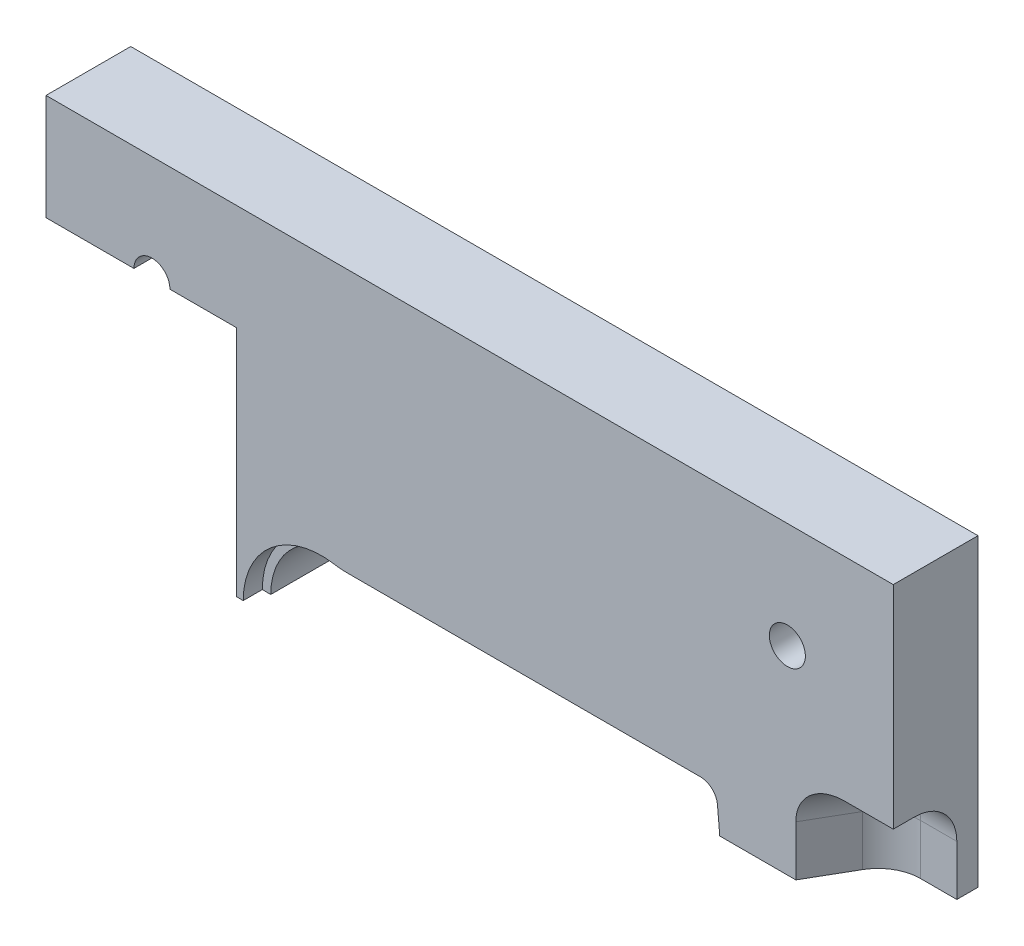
ISO-10303-21;
HEADER;
FILE_DESCRIPTION(('STEP AP214'),'2;1');
FILE_NAME('part.step','',(''),(''),'','','');
FILE_SCHEMA(('AUTOMOTIVE_DESIGN { 1 0 10303 214 1 1 1 1 }'));
ENDSEC;
DATA;
#1=APPLICATION_CONTEXT('core data for automotive mechanical design processes');
#2=APPLICATION_PROTOCOL_DEFINITION('international standard','automotive_design',2000,#1);
#3=PRODUCT_CONTEXT('',#1,'mechanical');
#4=PRODUCT('Part','Part','',(#3));
#5=PRODUCT_RELATED_PRODUCT_CATEGORY('part','',(#4));
#6=PRODUCT_DEFINITION_FORMATION('','',#4);
#7=PRODUCT_DEFINITION_CONTEXT('part definition',#1,'design');
#8=PRODUCT_DEFINITION('design','',#6,#7);
#9=PRODUCT_DEFINITION_SHAPE('','',#8);
#10=(LENGTH_UNIT() NAMED_UNIT(*) SI_UNIT(.MILLI.,.METRE.));
#11=(NAMED_UNIT(*) PLANE_ANGLE_UNIT() SI_UNIT($,.RADIAN.));
#12=(NAMED_UNIT(*) SI_UNIT($,.STERADIAN.) SOLID_ANGLE_UNIT());
#13=UNCERTAINTY_MEASURE_WITH_UNIT(LENGTH_MEASURE(1.E-05),#10,'distance_accuracy_value','');
#14=(GEOMETRIC_REPRESENTATION_CONTEXT(3) GLOBAL_UNCERTAINTY_ASSIGNED_CONTEXT((#13)) GLOBAL_UNIT_ASSIGNED_CONTEXT((#10,
#11,#12)) REPRESENTATION_CONTEXT('',''));
#15=CARTESIAN_POINT('',(0.,0.,0.));
#16=DIRECTION('',(0.,0.,1.));
#17=DIRECTION('',(1.,0.,0.));
#18=AXIS2_PLACEMENT_3D('',#15,#16,#17);
#19=CARTESIAN_POINT('',(175.,125.,20.));
#20=DIRECTION('',(0.,0.,1.));
#21=DIRECTION('',(1.,0.,0.));
#22=AXIS2_PLACEMENT_3D('',#19,#20,#21);
#23=CYLINDRICAL_SURFACE('',#22,4.24999999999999);
#24=CARTESIAN_POINT('',(175.,125.,20.));
#25=DIRECTION('',(0.,0.,1.));
#26=DIRECTION('',(1.,0.,0.));
#27=AXIS2_PLACEMENT_3D('',#24,#25,#26);
#28=CIRCLE('',#27,4.24999999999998);
#29=CARTESIAN_POINT('',(179.25,125.,20.));
#30=VERTEX_POINT('',#29);
#31=EDGE_CURVE('E355',#30,#30,#28,.T.);
#32=ORIENTED_EDGE('',*,*,#31,.T.);
#33=EDGE_LOOP('',(#32));
#34=FACE_BOUND('',#33,.T.);
#35=CARTESIAN_POINT('',(175.,125.,5.));
#36=DIRECTION('',(0.,0.,-1.));
#37=DIRECTION('',(-1.,0.,0.));
#38=AXIS2_PLACEMENT_3D('',#35,#36,#37);
#39=CIRCLE('',#38,4.24999999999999);
#40=CARTESIAN_POINT('',(170.75,125.,5.));
#41=VERTEX_POINT('',#40);
#42=EDGE_CURVE('E244',#41,#41,#39,.F.);
#43=ORIENTED_EDGE('',*,*,#42,.F.);
#44=EDGE_LOOP('',(#43));
#45=FACE_BOUND('',#44,.T.);
#46=ADVANCED_FACE('F28',(#34,#45),#23,.F.);
#47=CARTESIAN_POINT('',(25.,125.,20.));
#48=DIRECTION('',(0.,0.,1.));
#49=DIRECTION('',(1.,0.,0.));
#50=AXIS2_PLACEMENT_3D('',#47,#48,#49);
#51=CYLINDRICAL_SURFACE('',#50,4.24999999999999);
#52=CARTESIAN_POINT('',(25.,125.,20.));
#53=DIRECTION('',(0.,0.,1.));
#54=DIRECTION('',(1.,0.,0.));
#55=AXIS2_PLACEMENT_3D('',#52,#53,#54);
#56=CIRCLE('',#55,4.24999999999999);
#57=CARTESIAN_POINT('',(29.25,125.,20.));
#58=VERTEX_POINT('',#57);
#59=CARTESIAN_POINT('',(20.75,125.,20.));
#60=VERTEX_POINT('',#59);
#61=EDGE_CURVE('E361',#58,#60,#56,.T.);
#62=ORIENTED_EDGE('',*,*,#61,.T.);
#63=DIRECTION('',(0.,0.,1.));
#64=VECTOR('',#63,1.);
#65=CARTESIAN_POINT('',(20.75,125.,20.));
#66=LINE('',#65,#64);
#67=CARTESIAN_POINT('',(20.75,125.,5.));
#68=VERTEX_POINT('',#67);
#69=EDGE_CURVE('E522',#60,#68,#66,.F.);
#70=ORIENTED_EDGE('',*,*,#69,.T.);
#71=CARTESIAN_POINT('',(25.,125.,5.));
#72=DIRECTION('',(0.,0.,-1.));
#73=DIRECTION('',(-1.,0.,0.));
#74=AXIS2_PLACEMENT_3D('',#71,#72,#73);
#75=CIRCLE('',#74,4.24999999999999);
#76=CARTESIAN_POINT('',(29.25,125.,5.));
#77=VERTEX_POINT('',#76);
#78=EDGE_CURVE('E353',#77,#68,#75,.F.);
#79=ORIENTED_EDGE('',*,*,#78,.F.);
#80=DIRECTION('',(0.,0.,1.));
#81=VECTOR('',#80,1.);
#82=CARTESIAN_POINT('',(29.25,125.,20.));
#83=LINE('',#82,#81);
#84=EDGE_CURVE('E531',#77,#58,#83,.T.);
#85=ORIENTED_EDGE('',*,*,#84,.T.);
#86=EDGE_LOOP('',(#62,#70,#79,#85));
#87=FACE_BOUND('',#86,.T.);
#88=ADVANCED_FACE('F444',(#87),#51,.F.);
#89=CARTESIAN_POINT('',(0.,150.,0.));
#90=DIRECTION('',(0.,0.,-1.));
#91=DIRECTION('',(-1.,0.,0.));
#92=AXIS2_PLACEMENT_3D('',#89,#90,#91);
#93=PLANE('',#92);
#94=DIRECTION('',(1.,0.,0.));
#95=VECTOR('',#94,1.);
#96=CARTESIAN_POINT('',(0.,125.,0.));
#97=LINE('',#96,#95);
#98=CARTESIAN_POINT('',(0.,125.,0.));
#99=VERTEX_POINT('',#98);
#100=CARTESIAN_POINT('',(12.,125.,0.));
#101=VERTEX_POINT('',#100);
#102=EDGE_CURVE('E43',#99,#101,#97,.T.);
#103=ORIENTED_EDGE('',*,*,#102,.F.);
#104=DIRECTION('',(0.,-1.,0.));
#105=VECTOR('',#104,1.);
#106=CARTESIAN_POINT('',(0.,0.,0.));
#107=LINE('',#106,#105);
#108=CARTESIAN_POINT('',(0.,150.,0.));
#109=VERTEX_POINT('',#108);
#110=EDGE_CURVE('E324',#109,#99,#107,.T.);
#111=ORIENTED_EDGE('',*,*,#110,.F.);
#112=DIRECTION('',(-1.,0.,0.));
#113=VECTOR('',#112,1.);
#114=CARTESIAN_POINT('',(0.,150.,0.));
#115=LINE('',#114,#113);
#116=CARTESIAN_POINT('',(200.,150.,0.));
#117=VERTEX_POINT('',#116);
#118=EDGE_CURVE('E340',#117,#109,#115,.T.);
#119=ORIENTED_EDGE('',*,*,#118,.F.);
#120=DIRECTION('',(0.,1.,0.));
#121=VECTOR('',#120,1.);
#122=CARTESIAN_POINT('',(200.,0.,0.));
#123=LINE('',#122,#121);
#124=CARTESIAN_POINT('',(200.,78.12,0.));
#125=VERTEX_POINT('',#124);
#126=EDGE_CURVE('E338',#125,#117,#123,.T.);
#127=ORIENTED_EDGE('',*,*,#126,.F.);
#128=DIRECTION('',(1.,0.,0.));
#129=VECTOR('',#128,1.);
#130=CARTESIAN_POINT('',(0.,78.12,0.));
#131=LINE('',#130,#129);
#132=CARTESIAN_POINT('',(157.033723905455,78.12,0.));
#133=VERTEX_POINT('',#132);
#134=EDGE_CURVE('E538',#133,#125,#131,.T.);
#135=ORIENTED_EDGE('',*,*,#134,.F.);
#136=DIRECTION('',(-0.0871557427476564,0.996194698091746,0.));
#137=VECTOR('',#136,1.);
#138=CARTESIAN_POINT('',(156.512122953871,84.0819261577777,0.));
#139=LINE('',#138,#137);
#140=CARTESIAN_POINT('',(156.512122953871,84.0819261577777,0.));
#141=VERTEX_POINT('',#140);
#142=EDGE_CURVE('E311',#133,#141,#139,.T.);
#143=ORIENTED_EDGE('',*,*,#142,.T.);
#144=CARTESIAN_POINT('',(154.489847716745,83.905,0.));
#145=DIRECTION('',(0.,0.,1.));
#146=DIRECTION('',(-1.,0.,0.));
#147=AXIS2_PLACEMENT_3D('',#144,#145,#146);
#148=CIRCLE('',#147,2.03);
#149=CARTESIAN_POINT('',(154.489847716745,85.935,0.));
#150=VERTEX_POINT('',#149);
#151=EDGE_CURVE('E314',#141,#150,#148,.T.);
#152=ORIENTED_EDGE('',*,*,#151,.T.);
#153=DIRECTION('',(-1.,0.,0.));
#154=VECTOR('',#153,1.);
#155=CARTESIAN_POINT('',(71.0781905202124,85.935,0.));
#156=LINE('',#155,#154);
#157=CARTESIAN_POINT('',(71.0781905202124,85.935,0.));
#158=VERTEX_POINT('',#157);
#159=EDGE_CURVE('E317',#150,#158,#156,.T.);
#160=ORIENTED_EDGE('',*,*,#159,.T.);
#161=CARTESIAN_POINT('',(71.0781905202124,105.965,0.));
#162=DIRECTION('',(0.,0.,-1.));
#163=DIRECTION('',(-1.,0.,0.));
#164=AXIS2_PLACEMENT_3D('',#161,#162,#163);
#165=CIRCLE('',#164,20.03);
#166=CARTESIAN_POINT('',(67.7403932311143,86.2150630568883,0.));
#167=VERTEX_POINT('',#166);
#168=EDGE_CURVE('E305',#158,#167,#165,.T.);
#169=ORIENTED_EDGE('',*,*,#168,.T.);
#170=CARTESIAN_POINT('',(65.,70.,0.));
#171=DIRECTION('',(0.,0.,1.));
#172=DIRECTION('',(1.,0.,0.));
#173=AXIS2_PLACEMENT_3D('',#170,#171,#172);
#174=CIRCLE('',#173,16.445);
#175=CARTESIAN_POINT('',(48.555,70.,0.));
#176=VERTEX_POINT('',#175);
#177=EDGE_CURVE('E308',#167,#176,#174,.T.);
#178=ORIENTED_EDGE('',*,*,#177,.T.);
#179=DIRECTION('',(1.,0.,0.));
#180=VECTOR('',#179,1.);
#181=CARTESIAN_POINT('',(0.,70.,0.));
#182=LINE('',#181,#180);
#183=CARTESIAN_POINT('',(45.,70.,0.));
#184=VERTEX_POINT('',#183);
#185=EDGE_CURVE('E408',#184,#176,#182,.T.);
#186=ORIENTED_EDGE('',*,*,#185,.F.);
#187=DIRECTION('',(0.,-1.,0.));
#188=VECTOR('',#187,1.);
#189=CARTESIAN_POINT('',(45.,150.,0.));
#190=LINE('',#189,#188);
#191=CARTESIAN_POINT('',(45.,125.,0.));
#192=VERTEX_POINT('',#191);
#193=EDGE_CURVE('E415',#192,#184,#190,.T.);
#194=ORIENTED_EDGE('',*,*,#193,.F.);
#195=CARTESIAN_POINT('',(38.,125.,0.));
#196=VERTEX_POINT('',#195);
#197=EDGE_CURVE('E525',#196,#192,#97,.T.);
#198=ORIENTED_EDGE('',*,*,#197,.F.);
#199=CARTESIAN_POINT('',(25.,125.,0.));
#200=DIRECTION('',(0.,0.,-1.));
#201=DIRECTION('',(-1.,0.,0.));
#202=AXIS2_PLACEMENT_3D('',#199,#200,#201);
#203=CIRCLE('',#202,13.);
#204=EDGE_CURVE('E364',#101,#196,#203,.T.);
#205=ORIENTED_EDGE('',*,*,#204,.F.);
#206=EDGE_LOOP('',(#103,#111,#119,#127,#135,#143,#152,#160,#169,#178,#186,#194,#198,#205));
#207=FACE_BOUND('',#206,.T.);
#208=CARTESIAN_POINT('',(175.,125.,0.));
#209=DIRECTION('',(0.,0.,-1.));
#210=DIRECTION('',(-1.,0.,0.));
#211=AXIS2_PLACEMENT_3D('',#208,#209,#210);
#212=CIRCLE('',#211,13.);
#213=CARTESIAN_POINT('',(162.,125.,0.));
#214=VERTEX_POINT('',#213);
#215=EDGE_CURVE('E432',#214,#214,#212,.T.);
#216=ORIENTED_EDGE('',*,*,#215,.F.);
#217=EDGE_LOOP('',(#216));
#218=FACE_BOUND('',#217,.T.);
#219=ADVANCED_FACE('F450',(#207,#218),#93,.T.);
#220=CARTESIAN_POINT('',(71.0781905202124,105.965,0.));
#221=DIRECTION('',(0.,0.,1.));
#222=DIRECTION('',(1.,0.,0.));
#223=AXIS2_PLACEMENT_3D('',#220,#221,#222);
#224=CYLINDRICAL_SURFACE('',#223,20.03);
#225=CARTESIAN_POINT('',(71.0781905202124,105.965,15.5));
#226=DIRECTION('',(0.,0.,1.));
#227=DIRECTION('',(1.,0.,0.));
#228=AXIS2_PLACEMENT_3D('',#225,#226,#227);
#229=CIRCLE('',#228,20.03);
#230=CARTESIAN_POINT('',(67.7403932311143,86.2150630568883,15.5));
#231=VERTEX_POINT('',#230);
#232=CARTESIAN_POINT('',(71.0781905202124,85.935,15.5));
#233=VERTEX_POINT('',#232);
#234=EDGE_CURVE('E303',#231,#233,#229,.T.);
#235=ORIENTED_EDGE('',*,*,#234,.F.);
#236=DIRECTION('',(0.,0.,1.));
#237=VECTOR('',#236,1.);
#238=CARTESIAN_POINT('',(67.7403932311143,86.2150630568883,0.));
#239=LINE('',#238,#237);
#240=EDGE_CURVE('E320',#167,#231,#239,.T.);
#241=ORIENTED_EDGE('',*,*,#240,.F.);
#242=ORIENTED_EDGE('',*,*,#168,.F.);
#243=DIRECTION('',(0.,0.,1.));
#244=VECTOR('',#243,1.);
#245=CARTESIAN_POINT('',(71.0781905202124,85.935,0.));
#246=LINE('',#245,#244);
#247=EDGE_CURVE('E321',#158,#233,#246,.T.);
#248=ORIENTED_EDGE('',*,*,#247,.T.);
#249=EDGE_LOOP('',(#235,#241,#242,#248));
#250=FACE_BOUND('',#249,.T.);
#251=ADVANCED_FACE('F478',(#250),#224,.T.);
#252=CARTESIAN_POINT('',(71.0781905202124,85.935,0.));
#253=DIRECTION('',(0.,1.,0.));
#254=DIRECTION('',(-1.,0.,0.));
#255=AXIS2_PLACEMENT_3D('',#252,#253,#254);
#256=PLANE('',#255);
#257=DIRECTION('',(1.,0.,0.));
#258=VECTOR('',#257,1.);
#259=CARTESIAN_POINT('',(71.0781905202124,85.935,15.5));
#260=LINE('',#259,#258);
#261=CARTESIAN_POINT('',(154.489847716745,85.935,15.5));
#262=VERTEX_POINT('',#261);
#263=EDGE_CURVE('E301',#233,#262,#260,.T.);
#264=ORIENTED_EDGE('',*,*,#263,.F.);
#265=ORIENTED_EDGE('',*,*,#247,.F.);
#266=ORIENTED_EDGE('',*,*,#159,.F.);
#267=DIRECTION('',(0.,0.,1.));
#268=VECTOR('',#267,1.);
#269=CARTESIAN_POINT('',(154.489847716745,85.935,0.));
#270=LINE('',#269,#268);
#271=EDGE_CURVE('E325',#150,#262,#270,.T.);
#272=ORIENTED_EDGE('',*,*,#271,.T.);
#273=EDGE_LOOP('',(#264,#265,#266,#272));
#274=FACE_BOUND('',#273,.T.);
#275=ADVANCED_FACE('F474',(#274),#256,.F.);
#276=CARTESIAN_POINT('',(154.489847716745,83.905,0.));
#277=DIRECTION('',(0.,0.,1.));
#278=DIRECTION('',(1.,0.,0.));
#279=AXIS2_PLACEMENT_3D('',#276,#277,#278);
#280=CYLINDRICAL_SURFACE('',#279,2.03);
#281=CARTESIAN_POINT('',(154.489847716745,83.905,15.5));
#282=DIRECTION('',(0.,0.,1.));
#283=DIRECTION('',(1.,0.,0.));
#284=AXIS2_PLACEMENT_3D('',#281,#282,#283);
#285=CIRCLE('',#284,2.03);
#286=CARTESIAN_POINT('',(156.512122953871,84.0819261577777,15.5));
#287=VERTEX_POINT('',#286);
#288=EDGE_CURVE('E299',#262,#287,#285,.F.);
#289=ORIENTED_EDGE('',*,*,#288,.F.);
#290=ORIENTED_EDGE('',*,*,#271,.F.);
#291=ORIENTED_EDGE('',*,*,#151,.F.);
#292=DIRECTION('',(0.,0.,1.));
#293=VECTOR('',#292,1.);
#294=CARTESIAN_POINT('',(156.512122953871,84.0819261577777,0.));
#295=LINE('',#294,#293);
#296=EDGE_CURVE('E328',#141,#287,#295,.T.);
#297=ORIENTED_EDGE('',*,*,#296,.T.);
#298=EDGE_LOOP('',(#289,#290,#291,#297));
#299=FACE_BOUND('',#298,.T.);
#300=ADVANCED_FACE('F477',(#299),#280,.F.);
#301=CARTESIAN_POINT('',(156.512122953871,84.0819261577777,0.));
#302=DIRECTION('',(0.996194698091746,0.0871557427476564,0.));
#303=DIRECTION('',(-0.0871557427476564,0.996194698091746,0.));
#304=AXIS2_PLACEMENT_3D('',#301,#302,#303);
#305=PLANE('',#304);
#306=DIRECTION('',(0.0871557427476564,-0.996194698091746,0.));
#307=VECTOR('',#306,1.);
#308=CARTESIAN_POINT('',(156.512122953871,84.0819261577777,15.5));
#309=LINE('',#308,#307);
#310=CARTESIAN_POINT('',(157.033723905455,78.12,15.5));
#311=VERTEX_POINT('',#310);
#312=EDGE_CURVE('E291',#287,#311,#309,.T.);
#313=ORIENTED_EDGE('',*,*,#312,.F.);
#314=ORIENTED_EDGE('',*,*,#296,.F.);
#315=ORIENTED_EDGE('',*,*,#142,.F.);
#316=DIRECTION('',(0.,0.,1.));
#317=VECTOR('',#316,1.);
#318=CARTESIAN_POINT('',(157.033723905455,78.12,0.));
#319=LINE('',#318,#317);
#320=EDGE_CURVE('E331',#133,#311,#319,.T.);
#321=ORIENTED_EDGE('',*,*,#320,.T.);
#322=EDGE_LOOP('',(#313,#314,#315,#321));
#323=FACE_BOUND('',#322,.T.);
#324=ADVANCED_FACE('F482',(#323),#305,.F.);
#325=CARTESIAN_POINT('',(65.,70.,0.));
#326=DIRECTION('',(0.,0.,1.));
#327=DIRECTION('',(1.,0.,0.));
#328=AXIS2_PLACEMENT_3D('',#325,#326,#327);
#329=CYLINDRICAL_SURFACE('',#328,16.445);
#330=CARTESIAN_POINT('',(65.,70.,15.5));
#331=DIRECTION('',(0.,0.,1.));
#332=DIRECTION('',(1.,0.,0.));
#333=AXIS2_PLACEMENT_3D('',#330,#331,#332);
#334=CIRCLE('',#333,16.445);
#335=CARTESIAN_POINT('',(48.555,70.,15.5));
#336=VERTEX_POINT('',#335);
#337=EDGE_CURVE('E237',#336,#231,#334,.F.);
#338=ORIENTED_EDGE('',*,*,#337,.F.);
#339=DIRECTION('',(0.,0.,1.));
#340=VECTOR('',#339,1.);
#341=CARTESIAN_POINT('',(48.555,70.,0.));
#342=LINE('',#341,#340);
#343=EDGE_CURVE('E405',#336,#176,#342,.F.);
#344=ORIENTED_EDGE('',*,*,#343,.T.);
#345=ORIENTED_EDGE('',*,*,#177,.F.);
#346=ORIENTED_EDGE('',*,*,#240,.T.);
#347=EDGE_LOOP('',(#338,#344,#345,#346));
#348=FACE_BOUND('',#347,.T.);
#349=ADVANCED_FACE('F486',(#348),#329,.F.);
#350=CARTESIAN_POINT('',(0.,0.,20.));
#351=DIRECTION('',(1.,0.,0.));
#352=DIRECTION('',(0.,0.,-1.));
#353=AXIS2_PLACEMENT_3D('',#350,#351,#352);
#354=PLANE('',#353);
#355=ORIENTED_EDGE('',*,*,#110,.T.);
#356=DIRECTION('',(0.,0.,1.));
#357=VECTOR('',#356,1.);
#358=CARTESIAN_POINT('',(0.,125.,20.));
#359=LINE('',#358,#357);
#360=CARTESIAN_POINT('',(0.,125.,20.));
#361=VERTEX_POINT('',#360);
#362=EDGE_CURVE('E515',#99,#361,#359,.T.);
#363=ORIENTED_EDGE('',*,*,#362,.T.);
#364=DIRECTION('',(0.,-1.,0.));
#365=VECTOR('',#364,1.);
#366=CARTESIAN_POINT('',(0.,0.,20.));
#367=LINE('',#366,#365);
#368=CARTESIAN_POINT('',(0.,150.,20.));
#369=VERTEX_POINT('',#368);
#370=EDGE_CURVE('E342',#369,#361,#367,.T.);
#371=ORIENTED_EDGE('',*,*,#370,.F.);
#372=DIRECTION('',(0.,0.,-1.));
#373=VECTOR('',#372,1.);
#374=CARTESIAN_POINT('',(0.,150.,20.));
#375=LINE('',#374,#373);
#376=EDGE_CURVE('E349',#369,#109,#375,.T.);
#377=ORIENTED_EDGE('',*,*,#376,.T.);
#378=EDGE_LOOP('',(#355,#363,#371,#377));
#379=FACE_BOUND('',#378,.T.);
#380=ADVANCED_FACE('F490',(#379),#354,.F.);
#381=CARTESIAN_POINT('',(200.,0.,20.));
#382=DIRECTION('',(-1.,0.,0.));
#383=DIRECTION('',(0.,0.,1.));
#384=AXIS2_PLACEMENT_3D('',#381,#382,#383);
#385=PLANE('',#384);
#386=DIRECTION('',(0.,1.,0.));
#387=VECTOR('',#386,1.);
#388=CARTESIAN_POINT('',(200.,100.,5.));
#389=LINE('',#388,#387);
#390=CARTESIAN_POINT('',(200.,78.12,5.));
#391=VERTEX_POINT('',#390);
#392=CARTESIAN_POINT('',(200.,90.,5.));
#393=VERTEX_POINT('',#392);
#394=EDGE_CURVE('E428',#391,#393,#389,.T.);
#395=ORIENTED_EDGE('',*,*,#394,.F.);
#396=DIRECTION('',(0.,0.,-1.));
#397=VECTOR('',#396,1.);
#398=CARTESIAN_POINT('',(200.,78.12,20.));
#399=LINE('',#398,#397);
#400=EDGE_CURVE('E540',#391,#125,#399,.T.);
#401=ORIENTED_EDGE('',*,*,#400,.T.);
#402=ORIENTED_EDGE('',*,*,#126,.T.);
#403=DIRECTION('',(0.,0.,-1.));
#404=VECTOR('',#403,1.);
#405=CARTESIAN_POINT('',(200.,150.,20.));
#406=LINE('',#405,#404);
#407=CARTESIAN_POINT('',(200.,150.,20.));
#408=VERTEX_POINT('',#407);
#409=EDGE_CURVE('E241',#408,#117,#406,.T.);
#410=ORIENTED_EDGE('',*,*,#409,.F.);
#411=DIRECTION('',(0.,1.,0.));
#412=VECTOR('',#411,1.);
#413=CARTESIAN_POINT('',(200.,0.,20.));
#414=LINE('',#413,#412);
#415=CARTESIAN_POINT('',(200.,100.,20.));
#416=VERTEX_POINT('',#415);
#417=EDGE_CURVE('E345',#416,#408,#414,.T.);
#418=ORIENTED_EDGE('',*,*,#417,.F.);
#419=DIRECTION('',(0.,0.,1.));
#420=VECTOR('',#419,1.);
#421=CARTESIAN_POINT('',(200.,100.,5.));
#422=LINE('',#421,#420);
#423=CARTESIAN_POINT('',(200.,100.,15.));
#424=VERTEX_POINT('',#423);
#425=EDGE_CURVE('E430',#424,#416,#422,.T.);
#426=ORIENTED_EDGE('',*,*,#425,.F.);
#427=CARTESIAN_POINT('',(200.,90.,15.));
#428=DIRECTION('',(-1.,0.,0.));
#429=DIRECTION('',(0.,0.,1.));
#430=AXIS2_PLACEMENT_3D('',#427,#428,#429);
#431=CIRCLE('',#430,10.);
#432=EDGE_CURVE('E221',#424,#393,#431,.T.);
#433=ORIENTED_EDGE('',*,*,#432,.T.);
#434=EDGE_LOOP('',(#395,#401,#402,#410,#418,#426,#433));
#435=FACE_BOUND('',#434,.T.);
#436=ADVANCED_FACE('F504',(#435),#385,.F.);
#437=CARTESIAN_POINT('',(0.,150.,20.));
#438=DIRECTION('',(0.,-1.,0.));
#439=DIRECTION('',(0.,0.,-1.));
#440=AXIS2_PLACEMENT_3D('',#437,#438,#439);
#441=PLANE('',#440);
#442=ORIENTED_EDGE('',*,*,#118,.T.);
#443=ORIENTED_EDGE('',*,*,#376,.F.);
#444=DIRECTION('',(-1.,0.,0.));
#445=VECTOR('',#444,1.);
#446=CARTESIAN_POINT('',(0.,150.,20.));
#447=LINE('',#446,#445);
#448=EDGE_CURVE('E347',#408,#369,#447,.T.);
#449=ORIENTED_EDGE('',*,*,#448,.F.);
#450=ORIENTED_EDGE('',*,*,#409,.T.);
#451=EDGE_LOOP('',(#442,#443,#449,#450));
#452=FACE_BOUND('',#451,.T.);
#453=ADVANCED_FACE('F500',(#452),#441,.F.);
#454=CARTESIAN_POINT('',(0.,150.,20.));
#455=DIRECTION('',(0.,0.,-1.));
#456=DIRECTION('',(-1.,0.,0.));
#457=AXIS2_PLACEMENT_3D('',#454,#455,#456);
#458=PLANE('',#457);
#459=ORIENTED_EDGE('',*,*,#31,.F.);
#460=EDGE_LOOP('',(#459));
#461=FACE_BOUND('',#460,.T.);
#462=ORIENTED_EDGE('',*,*,#370,.T.);
#463=DIRECTION('',(1.,0.,0.));
#464=VECTOR('',#463,1.);
#465=CARTESIAN_POINT('',(0.,125.,20.));
#466=LINE('',#465,#464);
#467=EDGE_CURVE('E527',#361,#60,#466,.T.);
#468=ORIENTED_EDGE('',*,*,#467,.T.);
#469=ORIENTED_EDGE('',*,*,#61,.F.);
#470=CARTESIAN_POINT('',(45.,125.,20.));
#471=VERTEX_POINT('',#470);
#472=EDGE_CURVE('E410',#58,#471,#466,.T.);
#473=ORIENTED_EDGE('',*,*,#472,.T.);
#474=DIRECTION('',(0.,-1.,0.));
#475=VECTOR('',#474,1.);
#476=CARTESIAN_POINT('',(45.,150.,20.));
#477=LINE('',#476,#475);
#478=CARTESIAN_POINT('',(45.,70.,20.));
#479=VERTEX_POINT('',#478);
#480=EDGE_CURVE('E11',#471,#479,#477,.T.);
#481=ORIENTED_EDGE('',*,*,#480,.T.);
#482=DIRECTION('',(1.,0.,0.));
#483=VECTOR('',#482,1.);
#484=CARTESIAN_POINT('',(0.,70.,20.));
#485=LINE('',#484,#483);
#486=CARTESIAN_POINT('',(46.555,70.,20.));
#487=VERTEX_POINT('',#486);
#488=EDGE_CURVE('E401',#479,#487,#485,.T.);
#489=ORIENTED_EDGE('',*,*,#488,.T.);
#490=CARTESIAN_POINT('',(65.,70.,20.));
#491=DIRECTION('',(0.,0.,1.));
#492=DIRECTION('',(1.,0.,0.));
#493=AXIS2_PLACEMENT_3D('',#490,#491,#492);
#494=CIRCLE('',#493,18.445);
#495=CARTESIAN_POINT('',(68.0736730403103,88.1870986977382,20.));
#496=VERTEX_POINT('',#495);
#497=EDGE_CURVE('E269',#496,#487,#494,.T.);
#498=ORIENTED_EDGE('',*,*,#497,.F.);
#499=CARTESIAN_POINT('',(71.0781905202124,105.965,20.));
#500=DIRECTION('',(0.,0.,-1.));
#501=DIRECTION('',(1.,0.,0.));
#502=AXIS2_PLACEMENT_3D('',#499,#500,#501);
#503=CIRCLE('',#502,18.03);
#504=CARTESIAN_POINT('',(71.0781905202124,87.935,20.));
#505=VERTEX_POINT('',#504);
#506=EDGE_CURVE('E382',#505,#496,#503,.T.);
#507=ORIENTED_EDGE('',*,*,#506,.F.);
#508=DIRECTION('',(-1.,0.,0.));
#509=VECTOR('',#508,1.);
#510=CARTESIAN_POINT('',(154.489847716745,87.935,20.));
#511=LINE('',#510,#509);
#512=CARTESIAN_POINT('',(154.489847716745,87.935,20.));
#513=VERTEX_POINT('',#512);
#514=EDGE_CURVE('E379',#513,#505,#511,.T.);
#515=ORIENTED_EDGE('',*,*,#514,.F.);
#516=CARTESIAN_POINT('',(154.489847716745,83.905,20.));
#517=DIRECTION('',(0.,0.,1.));
#518=DIRECTION('',(1.,0.,0.));
#519=AXIS2_PLACEMENT_3D('',#516,#517,#518);
#520=CIRCLE('',#519,4.03);
#521=CARTESIAN_POINT('',(158.504512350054,84.2562376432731,20.));
#522=VERTEX_POINT('',#521);
#523=EDGE_CURVE('E376',#522,#513,#520,.T.);
#524=ORIENTED_EDGE('',*,*,#523,.F.);
#525=DIRECTION('',(-0.0871557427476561,0.996194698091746,0.));
#526=VECTOR('',#525,1.);
#527=CARTESIAN_POINT('',(159.041363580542,78.12,20.));
#528=LINE('',#527,#526);
#529=CARTESIAN_POINT('',(159.041363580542,78.12,20.));
#530=VERTEX_POINT('',#529);
#531=EDGE_CURVE('E373',#530,#522,#528,.T.);
#532=ORIENTED_EDGE('',*,*,#531,.F.);
#533=DIRECTION('',(1.,0.,0.));
#534=VECTOR('',#533,1.);
#535=CARTESIAN_POINT('',(0.,78.12,20.));
#536=LINE('',#535,#534);
#537=CARTESIAN_POINT('',(177.,78.12,20.));
#538=VERTEX_POINT('',#537);
#539=EDGE_CURVE('E230',#530,#538,#536,.T.);
#540=ORIENTED_EDGE('',*,*,#539,.T.);
#541=DIRECTION('',(0.,-1.,0.));
#542=VECTOR('',#541,1.);
#543=CARTESIAN_POINT('',(177.,100.,20.));
#544=LINE('',#543,#542);
#545=CARTESIAN_POINT('',(177.,90.,20.));
#546=VERTEX_POINT('',#545);
#547=EDGE_CURVE('E229',#546,#538,#544,.T.);
#548=ORIENTED_EDGE('',*,*,#547,.F.);
#549=CARTESIAN_POINT('',(188.547005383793,90.,20.));
#550=DIRECTION('',(0.,0.,-1.));
#551=DIRECTION('',(-1.,0.,0.));
#552=AXIS2_PLACEMENT_3D('',#549,#550,#551);
#553=ELLIPSE('',#552,11.5470053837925,10.);
#554=CARTESIAN_POINT('',(188.547005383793,100.,20.));
#555=VERTEX_POINT('',#554);
#556=EDGE_CURVE('E254',#546,#555,#553,.T.);
#557=ORIENTED_EDGE('',*,*,#556,.T.);
#558=DIRECTION('',(-1.,0.,0.));
#559=VECTOR('',#558,1.);
#560=CARTESIAN_POINT('',(200.,100.,20.));
#561=LINE('',#560,#559);
#562=EDGE_CURVE('E424',#416,#555,#561,.T.);
#563=ORIENTED_EDGE('',*,*,#562,.F.);
#564=ORIENTED_EDGE('',*,*,#417,.T.);
#565=ORIENTED_EDGE('',*,*,#448,.T.);
#566=EDGE_LOOP('',(#462,#468,#469,#473,#481,#489,#498,#507,#515,#524,#532,#540,#548,#557,#563,
#564,#565));
#567=FACE_BOUND('',#566,.T.);
#568=ADVANCED_FACE('F400',(#461,#567),#458,.F.);
#569=CARTESIAN_POINT('',(154.489847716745,72.335,15.5));
#570=DIRECTION('',(0.,0.,1.));
#571=DIRECTION('',(1.,0.,0.));
#572=AXIS2_PLACEMENT_3D('',#569,#570,#571);
#573=PLANE('',#572);
#574=DIRECTION('',(-1.,0.,0.));
#575=VECTOR('',#574,1.);
#576=CARTESIAN_POINT('',(154.489847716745,70.,15.5));
#577=LINE('',#576,#575);
#578=CARTESIAN_POINT('',(46.555,70.,15.5));
#579=VERTEX_POINT('',#578);
#580=EDGE_CURVE('E275',#336,#579,#577,.T.);
#581=ORIENTED_EDGE('',*,*,#580,.F.);
#582=ORIENTED_EDGE('',*,*,#337,.T.);
#583=ORIENTED_EDGE('',*,*,#234,.T.);
#584=ORIENTED_EDGE('',*,*,#263,.T.);
#585=ORIENTED_EDGE('',*,*,#288,.T.);
#586=ORIENTED_EDGE('',*,*,#312,.T.);
#587=DIRECTION('',(-1.,0.,0.));
#588=VECTOR('',#587,1.);
#589=CARTESIAN_POINT('',(154.489847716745,78.12,15.5));
#590=LINE('',#589,#588);
#591=CARTESIAN_POINT('',(159.041363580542,78.12,15.5));
#592=VERTEX_POINT('',#591);
#593=EDGE_CURVE('E529',#592,#311,#590,.T.);
#594=ORIENTED_EDGE('',*,*,#593,.F.);
#595=DIRECTION('',(-0.0871557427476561,0.996194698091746,0.));
#596=VECTOR('',#595,1.);
#597=CARTESIAN_POINT('',(159.041363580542,78.12,15.5));
#598=LINE('',#597,#596);
#599=CARTESIAN_POINT('',(158.504512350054,84.2562376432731,15.5));
#600=VERTEX_POINT('',#599);
#601=EDGE_CURVE('E386',#592,#600,#598,.T.);
#602=ORIENTED_EDGE('',*,*,#601,.T.);
#603=CARTESIAN_POINT('',(154.489847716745,83.905,15.5));
#604=DIRECTION('',(0.,0.,1.));
#605=DIRECTION('',(1.,0.,0.));
#606=AXIS2_PLACEMENT_3D('',#603,#604,#605);
#607=CIRCLE('',#606,4.03);
#608=CARTESIAN_POINT('',(154.489847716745,87.935,15.5));
#609=VERTEX_POINT('',#608);
#610=EDGE_CURVE('E389',#600,#609,#607,.T.);
#611=ORIENTED_EDGE('',*,*,#610,.T.);
#612=DIRECTION('',(-1.,0.,0.));
#613=VECTOR('',#612,1.);
#614=CARTESIAN_POINT('',(154.489847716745,87.935,15.5));
#615=LINE('',#614,#613);
#616=CARTESIAN_POINT('',(71.0781905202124,87.935,15.5));
#617=VERTEX_POINT('',#616);
#618=EDGE_CURVE('E285',#609,#617,#615,.T.);
#619=ORIENTED_EDGE('',*,*,#618,.T.);
#620=CARTESIAN_POINT('',(71.0781905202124,105.965,15.5));
#621=DIRECTION('',(0.,0.,-1.));
#622=DIRECTION('',(1.,0.,0.));
#623=AXIS2_PLACEMENT_3D('',#620,#621,#622);
#624=CIRCLE('',#623,18.03);
#625=CARTESIAN_POINT('',(68.0736730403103,88.1870986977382,15.5));
#626=VERTEX_POINT('',#625);
#627=EDGE_CURVE('E279',#617,#626,#624,.T.);
#628=ORIENTED_EDGE('',*,*,#627,.T.);
#629=CARTESIAN_POINT('',(65.,70.,15.5));
#630=DIRECTION('',(0.,0.,1.));
#631=DIRECTION('',(1.,0.,0.));
#632=AXIS2_PLACEMENT_3D('',#629,#630,#631);
#633=CIRCLE('',#632,18.445);
#634=EDGE_CURVE('E266',#626,#579,#633,.T.);
#635=ORIENTED_EDGE('',*,*,#634,.T.);
#636=EDGE_LOOP('',(#581,#582,#583,#584,#585,#586,#594,#602,#611,#619,#628,#635));
#637=FACE_BOUND('',#636,.T.);
#638=ADVANCED_FACE('F274',(#637),#573,.T.);
#639=CARTESIAN_POINT('',(65.,70.,15.5));
#640=DIRECTION('',(0.,0.,1.));
#641=DIRECTION('',(1.,0.,0.));
#642=AXIS2_PLACEMENT_3D('',#639,#640,#641);
#643=CYLINDRICAL_SURFACE('',#642,18.445);
#644=ORIENTED_EDGE('',*,*,#497,.T.);
#645=DIRECTION('',(0.,0.,1.));
#646=VECTOR('',#645,1.);
#647=CARTESIAN_POINT('',(46.555,70.,15.5));
#648=LINE('',#647,#646);
#649=EDGE_CURVE('E36',#487,#579,#648,.F.);
#650=ORIENTED_EDGE('',*,*,#649,.T.);
#651=ORIENTED_EDGE('',*,*,#634,.F.);
#652=DIRECTION('',(0.,0.,1.));
#653=VECTOR('',#652,1.);
#654=CARTESIAN_POINT('',(68.0736730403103,88.1870986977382,15.5));
#655=LINE('',#654,#653);
#656=EDGE_CURVE('E289',#626,#496,#655,.T.);
#657=ORIENTED_EDGE('',*,*,#656,.T.);
#658=EDGE_LOOP('',(#644,#650,#651,#657));
#659=FACE_BOUND('',#658,.T.);
#660=ADVANCED_FACE('F265',(#659),#643,.F.);
#661=CARTESIAN_POINT('',(71.0781905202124,105.965,15.5));
#662=DIRECTION('',(0.,0.,1.));
#663=DIRECTION('',(1.,0.,0.));
#664=AXIS2_PLACEMENT_3D('',#661,#662,#663);
#665=CYLINDRICAL_SURFACE('',#664,18.03);
#666=ORIENTED_EDGE('',*,*,#506,.T.);
#667=ORIENTED_EDGE('',*,*,#656,.F.);
#668=ORIENTED_EDGE('',*,*,#627,.F.);
#669=DIRECTION('',(0.,0.,1.));
#670=VECTOR('',#669,1.);
#671=CARTESIAN_POINT('',(71.0781905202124,87.935,15.5));
#672=LINE('',#671,#670);
#673=EDGE_CURVE('E292',#617,#505,#672,.T.);
#674=ORIENTED_EDGE('',*,*,#673,.T.);
#675=EDGE_LOOP('',(#666,#667,#668,#674));
#676=FACE_BOUND('',#675,.T.);
#677=ADVANCED_FACE('F398',(#676),#665,.T.);
#678=CARTESIAN_POINT('',(154.489847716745,87.935,15.5));
#679=DIRECTION('',(0.,1.,0.));
#680=DIRECTION('',(0.,0.,1.));
#681=AXIS2_PLACEMENT_3D('',#678,#679,#680);
#682=PLANE('',#681);
#683=ORIENTED_EDGE('',*,*,#514,.T.);
#684=ORIENTED_EDGE('',*,*,#673,.F.);
#685=ORIENTED_EDGE('',*,*,#618,.F.);
#686=DIRECTION('',(0.,0.,1.));
#687=VECTOR('',#686,1.);
#688=CARTESIAN_POINT('',(154.489847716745,87.935,15.5));
#689=LINE('',#688,#687);
#690=EDGE_CURVE('E294',#609,#513,#689,.T.);
#691=ORIENTED_EDGE('',*,*,#690,.T.);
#692=EDGE_LOOP('',(#683,#684,#685,#691));
#693=FACE_BOUND('',#692,.T.);
#694=ADVANCED_FACE('F394',(#693),#682,.F.);
#695=CARTESIAN_POINT('',(154.489847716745,83.905,15.5));
#696=DIRECTION('',(0.,0.,1.));
#697=DIRECTION('',(1.,0.,0.));
#698=AXIS2_PLACEMENT_3D('',#695,#696,#697);
#699=CYLINDRICAL_SURFACE('',#698,4.03);
#700=ORIENTED_EDGE('',*,*,#523,.T.);
#701=ORIENTED_EDGE('',*,*,#690,.F.);
#702=ORIENTED_EDGE('',*,*,#610,.F.);
#703=DIRECTION('',(0.,0.,1.));
#704=VECTOR('',#703,1.);
#705=CARTESIAN_POINT('',(158.504512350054,84.2562376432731,15.5));
#706=LINE('',#705,#704);
#707=EDGE_CURVE('E283',#600,#522,#706,.T.);
#708=ORIENTED_EDGE('',*,*,#707,.T.);
#709=EDGE_LOOP('',(#700,#701,#702,#708));
#710=FACE_BOUND('',#709,.T.);
#711=ADVANCED_FACE('F465',(#710),#699,.F.);
#712=CARTESIAN_POINT('',(159.041363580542,78.12,15.5));
#713=DIRECTION('',(0.996194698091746,0.0871557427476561,0.));
#714=DIRECTION('',(-0.0871557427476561,0.996194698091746,0.));
#715=AXIS2_PLACEMENT_3D('',#712,#713,#714);
#716=PLANE('',#715);
#717=ORIENTED_EDGE('',*,*,#531,.T.);
#718=ORIENTED_EDGE('',*,*,#707,.F.);
#719=ORIENTED_EDGE('',*,*,#601,.F.);
#720=DIRECTION('',(0.,0.,1.));
#721=VECTOR('',#720,1.);
#722=CARTESIAN_POINT('',(159.041363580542,78.12,15.5));
#723=LINE('',#722,#721);
#724=EDGE_CURVE('E280',#592,#530,#723,.T.);
#725=ORIENTED_EDGE('',*,*,#724,.T.);
#726=EDGE_LOOP('',(#717,#718,#719,#725));
#727=FACE_BOUND('',#726,.T.);
#728=ADVANCED_FACE('F468',(#727),#716,.F.);
#729=CARTESIAN_POINT('',(25.,125.,5.));
#730=DIRECTION('',(0.,0.,-1.));
#731=DIRECTION('',(-1.,0.,0.));
#732=AXIS2_PLACEMENT_3D('',#729,#730,#731);
#733=PLANE('',#732);
#734=DIRECTION('',(1.,0.,0.));
#735=VECTOR('',#734,1.);
#736=CARTESIAN_POINT('',(25.,125.,5.));
#737=LINE('',#736,#735);
#738=CARTESIAN_POINT('',(12.,125.,5.));
#739=VERTEX_POINT('',#738);
#740=EDGE_CURVE('E523',#739,#68,#737,.T.);
#741=ORIENTED_EDGE('',*,*,#740,.F.);
#742=CARTESIAN_POINT('',(25.,125.,5.));
#743=DIRECTION('',(0.,0.,-1.));
#744=DIRECTION('',(-1.,0.,0.));
#745=AXIS2_PLACEMENT_3D('',#742,#743,#744);
#746=CIRCLE('',#745,13.);
#747=CARTESIAN_POINT('',(38.,125.,5.));
#748=VERTEX_POINT('',#747);
#749=EDGE_CURVE('E356',#739,#748,#746,.T.);
#750=ORIENTED_EDGE('',*,*,#749,.T.);
#751=EDGE_CURVE('E51',#77,#748,#737,.T.);
#752=ORIENTED_EDGE('',*,*,#751,.F.);
#753=ORIENTED_EDGE('',*,*,#78,.T.);
#754=EDGE_LOOP('',(#741,#750,#752,#753));
#755=FACE_BOUND('',#754,.T.);
#756=ADVANCED_FACE('F472',(#755),#733,.T.);
#757=CARTESIAN_POINT('',(25.,125.,5.));
#758=DIRECTION('',(0.,0.,-1.));
#759=DIRECTION('',(-1.,0.,0.));
#760=AXIS2_PLACEMENT_3D('',#757,#758,#759);
#761=CYLINDRICAL_SURFACE('',#760,13.);
#762=ORIENTED_EDGE('',*,*,#204,.T.);
#763=DIRECTION('',(0.,0.,-1.));
#764=VECTOR('',#763,1.);
#765=CARTESIAN_POINT('',(38.,125.,5.));
#766=LINE('',#765,#764);
#767=EDGE_CURVE('E259',#196,#748,#766,.F.);
#768=ORIENTED_EDGE('',*,*,#767,.T.);
#769=ORIENTED_EDGE('',*,*,#749,.F.);
#770=DIRECTION('',(0.,0.,-1.));
#771=VECTOR('',#770,1.);
#772=CARTESIAN_POINT('',(12.,125.,5.));
#773=LINE('',#772,#771);
#774=EDGE_CURVE('E220',#739,#101,#773,.T.);
#775=ORIENTED_EDGE('',*,*,#774,.T.);
#776=EDGE_LOOP('',(#762,#768,#769,#775));
#777=FACE_BOUND('',#776,.T.);
#778=ADVANCED_FACE('F454',(#777),#761,.F.);
#779=CARTESIAN_POINT('',(175.,125.,5.));
#780=DIRECTION('',(0.,0.,-1.));
#781=DIRECTION('',(-1.,0.,0.));
#782=AXIS2_PLACEMENT_3D('',#779,#780,#781);
#783=PLANE('',#782);
#784=CARTESIAN_POINT('',(175.,125.,5.));
#785=DIRECTION('',(0.,0.,-1.));
#786=DIRECTION('',(-1.,0.,0.));
#787=AXIS2_PLACEMENT_3D('',#784,#785,#786);
#788=CIRCLE('',#787,13.);
#789=CARTESIAN_POINT('',(162.,125.,5.));
#790=VERTEX_POINT('',#789);
#791=EDGE_CURVE('E434',#790,#790,#788,.T.);
#792=ORIENTED_EDGE('',*,*,#791,.T.);
#793=EDGE_LOOP('',(#792));
#794=FACE_BOUND('',#793,.T.);
#795=ORIENTED_EDGE('',*,*,#42,.T.);
#796=EDGE_LOOP('',(#795));
#797=FACE_BOUND('',#796,.T.);
#798=ADVANCED_FACE('F441',(#794,#797),#783,.T.);
#799=CARTESIAN_POINT('',(175.,125.,5.));
#800=DIRECTION('',(0.,0.,-1.));
#801=DIRECTION('',(-1.,0.,0.));
#802=AXIS2_PLACEMENT_3D('',#799,#800,#801);
#803=CYLINDRICAL_SURFACE('',#802,13.);
#804=ORIENTED_EDGE('',*,*,#791,.F.);
#805=EDGE_LOOP('',(#804));
#806=FACE_BOUND('',#805,.T.);
#807=ORIENTED_EDGE('',*,*,#215,.T.);
#808=EDGE_LOOP('',(#807));
#809=FACE_BOUND('',#808,.T.);
#810=ADVANCED_FACE('F595',(#806,#809),#803,.F.);
#811=CARTESIAN_POINT('',(177.,100.,20.));
#812=DIRECTION('',(0.866025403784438,0.,0.500000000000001));
#813=DIRECTION('',(0.500000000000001,0.,-0.866025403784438));
#814=AXIS2_PLACEMENT_3D('',#811,#812,#813);
#815=PLANE('',#814);
#816=ORIENTED_EDGE('',*,*,#547,.T.);
#817=DIRECTION('',(-0.500000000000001,0.,0.866025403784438));
#818=VECTOR('',#817,1.);
#819=CARTESIAN_POINT('',(177.,78.12,20.));
#820=LINE('',#819,#818);
#821=CARTESIAN_POINT('',(182.773502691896,78.12,9.99999999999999));
#822=VERTEX_POINT('',#821);
#823=EDGE_CURVE('E212',#538,#822,#820,.F.);
#824=ORIENTED_EDGE('',*,*,#823,.T.);
#825=DIRECTION('',(0.,-1.,0.));
#826=VECTOR('',#825,1.);
#827=CARTESIAN_POINT('',(182.773502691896,100.,9.99999999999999));
#828=LINE('',#827,#826);
#829=CARTESIAN_POINT('',(182.773502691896,90.,9.99999999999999));
#830=VERTEX_POINT('',#829);
#831=EDGE_CURVE('E226',#822,#830,#828,.F.);
#832=ORIENTED_EDGE('',*,*,#831,.T.);
#833=DIRECTION('',(-0.500000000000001,0.,0.866025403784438));
#834=VECTOR('',#833,1.);
#835=CARTESIAN_POINT('',(177.,90.,20.));
#836=LINE('',#835,#834);
#837=EDGE_CURVE('E236',#830,#546,#836,.T.);
#838=ORIENTED_EDGE('',*,*,#837,.T.);
#839=EDGE_LOOP('',(#816,#824,#832,#838));
#840=FACE_BOUND('',#839,.T.);
#841=ADVANCED_FACE('F30',(#840),#815,.T.);
#842=CARTESIAN_POINT('',(200.,100.,5.));
#843=DIRECTION('',(0.,1.,0.));
#844=DIRECTION('',(0.,0.,1.));
#845=AXIS2_PLACEMENT_3D('',#842,#843,#844);
#846=PLANE('',#845);
#847=ORIENTED_EDGE('',*,*,#562,.T.);
#848=DIRECTION('',(0.500000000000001,0.,-0.866025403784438));
#849=VECTOR('',#848,1.);
#850=CARTESIAN_POINT('',(194.320508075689,100.,10.));
#851=LINE('',#850,#849);
#852=CARTESIAN_POINT('',(191.433756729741,100.,15.));
#853=VERTEX_POINT('',#852);
#854=EDGE_CURVE('E248',#555,#853,#851,.T.);
#855=ORIENTED_EDGE('',*,*,#854,.T.);
#856=DIRECTION('',(-1.,0.,0.));
#857=VECTOR('',#856,1.);
#858=CARTESIAN_POINT('',(200.,100.,15.));
#859=LINE('',#858,#857);
#860=EDGE_CURVE('E239',#853,#424,#859,.F.);
#861=ORIENTED_EDGE('',*,*,#860,.T.);
#862=ORIENTED_EDGE('',*,*,#425,.T.);
#863=EDGE_LOOP('',(#847,#855,#861,#862));
#864=FACE_BOUND('',#863,.T.);
#865=ADVANCED_FACE('F571',(#864),#846,.F.);
#866=CARTESIAN_POINT('',(200.,50.,5.));
#867=DIRECTION('',(0.,0.,-1.));
#868=DIRECTION('',(-1.,0.,0.));
#869=AXIS2_PLACEMENT_3D('',#866,#867,#868);
#870=PLANE('',#869);
#871=DIRECTION('',(0.,1.,0.));
#872=VECTOR('',#871,1.);
#873=CARTESIAN_POINT('',(191.433756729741,50.,5.));
#874=LINE('',#873,#872);
#875=CARTESIAN_POINT('',(191.433756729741,90.,5.));
#876=VERTEX_POINT('',#875);
#877=CARTESIAN_POINT('',(191.433756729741,78.12,5.));
#878=VERTEX_POINT('',#877);
#879=EDGE_CURVE('E250',#876,#878,#874,.F.);
#880=ORIENTED_EDGE('',*,*,#879,.T.);
#881=DIRECTION('',(1.,0.,0.));
#882=VECTOR('',#881,1.);
#883=CARTESIAN_POINT('',(200.,78.12,5.));
#884=LINE('',#883,#882);
#885=EDGE_CURVE('E215',#878,#391,#884,.T.);
#886=ORIENTED_EDGE('',*,*,#885,.T.);
#887=ORIENTED_EDGE('',*,*,#394,.T.);
#888=DIRECTION('',(-1.,0.,0.));
#889=VECTOR('',#888,1.);
#890=CARTESIAN_POINT('',(185.660254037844,90.,5.));
#891=LINE('',#890,#889);
#892=EDGE_CURVE('E252',#393,#876,#891,.T.);
#893=ORIENTED_EDGE('',*,*,#892,.T.);
#894=EDGE_LOOP('',(#880,#886,#887,#893));
#895=FACE_BOUND('',#894,.T.);
#896=ADVANCED_FACE('F603',(#895),#870,.F.);
#897=CARTESIAN_POINT('',(200.,90.,15.));
#898=DIRECTION('',(1.,0.,0.));
#899=DIRECTION('',(0.,0.,-1.));
#900=AXIS2_PLACEMENT_3D('',#897,#898,#899);
#901=CYLINDRICAL_SURFACE('',#900,10.);
#902=ORIENTED_EDGE('',*,*,#432,.F.);
#903=ORIENTED_EDGE('',*,*,#860,.F.);
#904=CARTESIAN_POINT('',(191.433756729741,90.,15.));
#905=DIRECTION('',(1.,0.,0.));
#906=DIRECTION('',(0.,0.,-1.));
#907=AXIS2_PLACEMENT_3D('',#904,#905,#906);
#908=CIRCLE('',#907,10.);
#909=EDGE_CURVE('E421',#876,#853,#908,.T.);
#910=ORIENTED_EDGE('',*,*,#909,.F.);
#911=ORIENTED_EDGE('',*,*,#892,.F.);
#912=EDGE_LOOP('',(#902,#903,#910,#911));
#913=FACE_BOUND('',#912,.T.);
#914=ADVANCED_FACE('F581',(#913),#901,.F.);
#915=CARTESIAN_POINT('',(191.433756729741,50.,15.));
#916=DIRECTION('',(0.,-1.,0.));
#917=DIRECTION('',(0.,0.,-1.));
#918=AXIS2_PLACEMENT_3D('',#915,#916,#917);
#919=CYLINDRICAL_SURFACE('',#918,10.);
#920=ORIENTED_EDGE('',*,*,#831,.F.);
#921=CARTESIAN_POINT('',(191.433756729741,78.12,15.));
#922=DIRECTION('',(0.,1.,0.));
#923=DIRECTION('',(0.,0.,1.));
#924=AXIS2_PLACEMENT_3D('',#921,#922,#923);
#925=CIRCLE('',#924,10.);
#926=EDGE_CURVE('E209',#822,#878,#925,.F.);
#927=ORIENTED_EDGE('',*,*,#926,.T.);
#928=ORIENTED_EDGE('',*,*,#879,.F.);
#929=CARTESIAN_POINT('',(191.433756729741,90.,15.));
#930=DIRECTION('',(0.,-1.,0.));
#931=DIRECTION('',(0.,0.,-1.));
#932=AXIS2_PLACEMENT_3D('',#929,#930,#931);
#933=CIRCLE('',#932,10.);
#934=EDGE_CURVE('E234',#830,#876,#933,.T.);
#935=ORIENTED_EDGE('',*,*,#934,.F.);
#936=EDGE_LOOP('',(#920,#927,#928,#935));
#937=FACE_BOUND('',#936,.T.);
#938=ADVANCED_FACE('F232',(#937),#919,.F.);
#939=CARTESIAN_POINT('',(191.433756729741,90.,15.));
#940=DIRECTION('',(0.,0.,1.));
#941=DIRECTION('',(1.,0.,0.));
#942=AXIS2_PLACEMENT_3D('',#939,#940,#941);
#943=SPHERICAL_SURFACE('',#942,10.);
#944=ORIENTED_EDGE('',*,*,#934,.T.);
#945=ORIENTED_EDGE('',*,*,#909,.T.);
#946=CARTESIAN_POINT('',(191.433756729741,90.,15.));
#947=DIRECTION('',(-0.500000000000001,0.,0.866025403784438));
#948=DIRECTION('',(0.866025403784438,0.,0.500000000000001));
#949=AXIS2_PLACEMENT_3D('',#946,#947,#948);
#950=CIRCLE('',#949,10.);
#951=EDGE_CURVE('E417',#830,#853,#950,.F.);
#952=ORIENTED_EDGE('',*,*,#951,.F.);
#953=EDGE_LOOP('',(#944,#945,#952));
#954=FACE_BOUND('',#953,.T.);
#955=ADVANCED_FACE('F576',(#954),#943,.F.);
#956=CARTESIAN_POINT('',(185.660254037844,90.,25.));
#957=DIRECTION('',(-0.500000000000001,0.,0.866025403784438));
#958=DIRECTION('',(0.866025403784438,0.,0.500000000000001));
#959=AXIS2_PLACEMENT_3D('',#956,#957,#958);
#960=CYLINDRICAL_SURFACE('',#959,10.);
#961=ORIENTED_EDGE('',*,*,#951,.T.);
#962=ORIENTED_EDGE('',*,*,#854,.F.);
#963=ORIENTED_EDGE('',*,*,#556,.F.);
#964=ORIENTED_EDGE('',*,*,#837,.F.);
#965=EDGE_LOOP('',(#961,#962,#963,#964));
#966=FACE_BOUND('',#965,.T.);
#967=ADVANCED_FACE('F574',(#966),#960,.F.);
#968=CARTESIAN_POINT('',(82.4133961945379,78.12,333.498405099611));
#969=DIRECTION('',(0.,1.,0.));
#970=DIRECTION('',(0.,0.,1.));
#971=AXIS2_PLACEMENT_3D('',#968,#969,#970);
#972=PLANE('',#971);
#973=ORIENTED_EDGE('',*,*,#724,.F.);
#974=ORIENTED_EDGE('',*,*,#593,.T.);
#975=ORIENTED_EDGE('',*,*,#320,.F.);
#976=ORIENTED_EDGE('',*,*,#134,.T.);
#977=ORIENTED_EDGE('',*,*,#400,.F.);
#978=ORIENTED_EDGE('',*,*,#885,.F.);
#979=ORIENTED_EDGE('',*,*,#926,.F.);
#980=ORIENTED_EDGE('',*,*,#823,.F.);
#981=ORIENTED_EDGE('',*,*,#539,.F.);
#982=EDGE_LOOP('',(#973,#974,#975,#976,#977,#978,#979,#980,#981));
#983=FACE_BOUND('',#982,.T.);
#984=ADVANCED_FACE('F211',(#983),#972,.F.);
#985=CARTESIAN_POINT('',(-8.17211664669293,125.,333.498405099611));
#986=DIRECTION('',(0.,1.,0.));
#987=DIRECTION('',(0.,0.,1.));
#988=AXIS2_PLACEMENT_3D('',#985,#986,#987);
#989=PLANE('',#988);
#990=ORIENTED_EDGE('',*,*,#362,.F.);
#991=ORIENTED_EDGE('',*,*,#102,.T.);
#992=ORIENTED_EDGE('',*,*,#774,.F.);
#993=ORIENTED_EDGE('',*,*,#740,.T.);
#994=ORIENTED_EDGE('',*,*,#69,.F.);
#995=ORIENTED_EDGE('',*,*,#467,.F.);
#996=EDGE_LOOP('',(#990,#991,#992,#993,#994,#995));
#997=FACE_BOUND('',#996,.T.);
#998=ADVANCED_FACE('F618',(#997),#989,.F.);
#999=CARTESIAN_POINT('',(45.,125.,333.498405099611));
#1000=DIRECTION('',(1.,0.,0.));
#1001=DIRECTION('',(0.,1.,0.));
#1002=AXIS2_PLACEMENT_3D('',#999,#1000,#1001);
#1003=PLANE('',#1002);
#1004=DIRECTION('',(0.,0.,-1.));
#1005=VECTOR('',#1004,1.);
#1006=CARTESIAN_POINT('',(45.,125.,333.498405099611));
#1007=LINE('',#1006,#1005);
#1008=EDGE_CURVE('E545',#471,#192,#1007,.T.);
#1009=ORIENTED_EDGE('',*,*,#1008,.T.);
#1010=ORIENTED_EDGE('',*,*,#193,.T.);
#1011=DIRECTION('',(0.,0.,-1.));
#1012=VECTOR('',#1011,1.);
#1013=CARTESIAN_POINT('',(45.,70.,333.498405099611));
#1014=LINE('',#1013,#1012);
#1015=EDGE_CURVE('E547',#479,#184,#1014,.T.);
#1016=ORIENTED_EDGE('',*,*,#1015,.F.);
#1017=ORIENTED_EDGE('',*,*,#480,.F.);
#1018=EDGE_LOOP('',(#1009,#1010,#1016,#1017));
#1019=FACE_BOUND('',#1018,.T.);
#1020=ADVANCED_FACE('F617',(#1019),#1003,.F.);
#1021=ORIENTED_EDGE('',*,*,#472,.F.);
#1022=ORIENTED_EDGE('',*,*,#84,.F.);
#1023=ORIENTED_EDGE('',*,*,#751,.T.);
#1024=ORIENTED_EDGE('',*,*,#767,.F.);
#1025=ORIENTED_EDGE('',*,*,#197,.T.);
#1026=ORIENTED_EDGE('',*,*,#1008,.F.);
#1027=EDGE_LOOP('',(#1021,#1022,#1023,#1024,#1025,#1026));
#1028=FACE_BOUND('',#1027,.T.);
#1029=ADVANCED_FACE('F588',(#1028),#989,.F.);
#1030=CARTESIAN_POINT('',(65.,70.,333.498405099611));
#1031=DIRECTION('',(0.,1.,0.));
#1032=DIRECTION('',(0.,0.,1.));
#1033=AXIS2_PLACEMENT_3D('',#1030,#1031,#1032);
#1034=PLANE('',#1033);
#1035=ORIENTED_EDGE('',*,*,#1015,.T.);
#1036=ORIENTED_EDGE('',*,*,#185,.T.);
#1037=ORIENTED_EDGE('',*,*,#343,.F.);
#1038=ORIENTED_EDGE('',*,*,#580,.T.);
#1039=ORIENTED_EDGE('',*,*,#649,.F.);
#1040=ORIENTED_EDGE('',*,*,#488,.F.);
#1041=EDGE_LOOP('',(#1035,#1036,#1037,#1038,#1039,#1040));
#1042=FACE_BOUND('',#1041,.T.);
#1043=ADVANCED_FACE('F549',(#1042),#1034,.F.);
#1044=CLOSED_SHELL('',(#46,#88,#219,#251,#275,#300,#324,#349,#380,#436,#453,#568,#638,#660,#677,
#694,#711,#728,#756,#778,#798,#810,#841,#865,#896,#914,#938,#955,#967,#984,#998,#1020,#1029,#1043));
#1045=MANIFOLD_SOLID_BREP('B2',#1044);
#1046=ADVANCED_BREP_SHAPE_REPRESENTATION('',(#18,#1045),#14);
#1047=SHAPE_DEFINITION_REPRESENTATION(#9,#1046);
ENDSEC;
END-ISO-10303-21;
